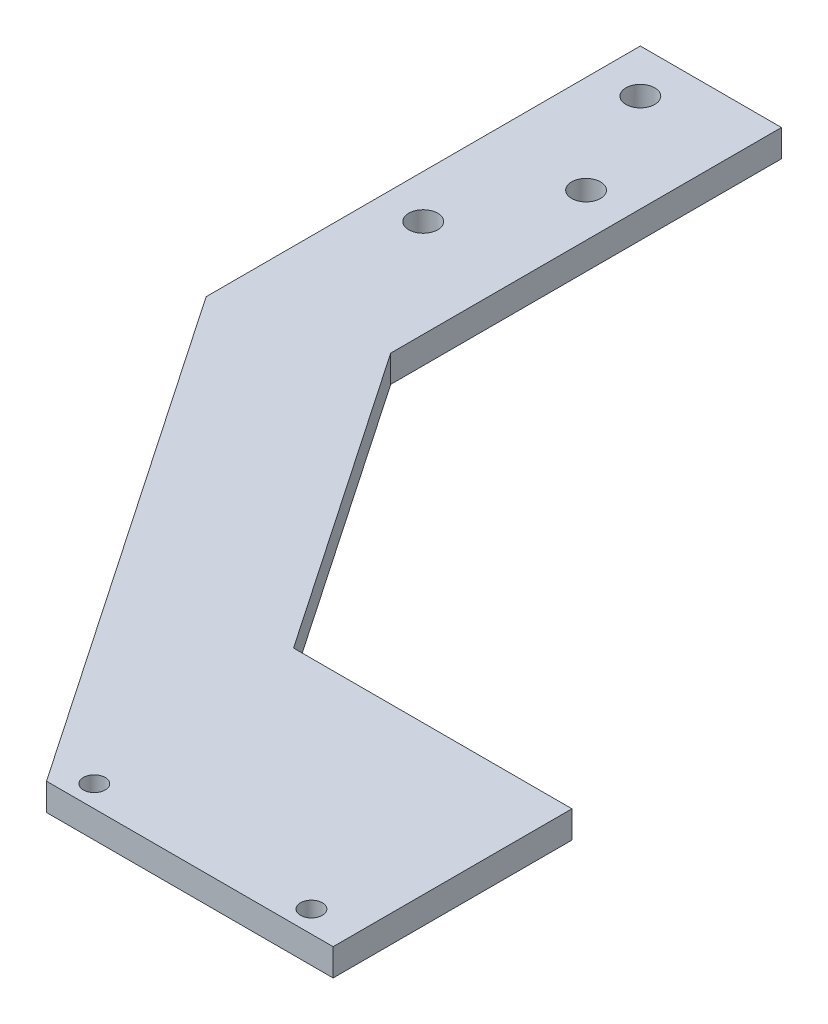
ISO-10303-21;
HEADER;
FILE_DESCRIPTION(('STEP AP214'),'2;1');
FILE_NAME('part.step','',(''),(''),'','','');
FILE_SCHEMA(('AUTOMOTIVE_DESIGN { 1 0 10303 214 1 1 1 1 }'));
ENDSEC;
DATA;
#1=APPLICATION_CONTEXT('core data for automotive mechanical design processes');
#2=APPLICATION_PROTOCOL_DEFINITION('international standard','automotive_design',2000,#1);
#3=PRODUCT_CONTEXT('',#1,'mechanical');
#4=PRODUCT('Part','Part','',(#3));
#5=PRODUCT_RELATED_PRODUCT_CATEGORY('part','',(#4));
#6=PRODUCT_DEFINITION_FORMATION('','',#4);
#7=PRODUCT_DEFINITION_CONTEXT('part definition',#1,'design');
#8=PRODUCT_DEFINITION('design','',#6,#7);
#9=PRODUCT_DEFINITION_SHAPE('','',#8);
#10=(LENGTH_UNIT() NAMED_UNIT(*) SI_UNIT(.MILLI.,.METRE.));
#11=(NAMED_UNIT(*) PLANE_ANGLE_UNIT() SI_UNIT($,.RADIAN.));
#12=(NAMED_UNIT(*) SI_UNIT($,.STERADIAN.) SOLID_ANGLE_UNIT());
#13=UNCERTAINTY_MEASURE_WITH_UNIT(LENGTH_MEASURE(1.E-05),#10,'distance_accuracy_value','');
#14=(GEOMETRIC_REPRESENTATION_CONTEXT(3) GLOBAL_UNCERTAINTY_ASSIGNED_CONTEXT((#13)) GLOBAL_UNIT_ASSIGNED_CONTEXT((#10,
#11,#12)) REPRESENTATION_CONTEXT('',''));
#15=CARTESIAN_POINT('',(0.,0.,0.));
#16=DIRECTION('',(0.,0.,1.));
#17=DIRECTION('',(1.,0.,0.));
#18=AXIS2_PLACEMENT_3D('',#15,#16,#17);
#19=CARTESIAN_POINT('',(0.,6.35,0.));
#20=DIRECTION('',(0.,-1.,0.));
#21=DIRECTION('',(0.,0.,-1.));
#22=AXIS2_PLACEMENT_3D('',#19,#20,#21);
#23=PLANE('',#22);
#24=CARTESIAN_POINT('',(85.598,6.35,213.36));
#25=DIRECTION('',(0.,1.,0.));
#26=DIRECTION('',(0.,0.,1.));
#27=AXIS2_PLACEMENT_3D('',#24,#25,#26);
#28=CIRCLE('',#27,2.55270000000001);
#29=CARTESIAN_POINT('',(85.598,6.35,215.9127));
#30=VERTEX_POINT('',#29);
#31=EDGE_CURVE('E191',#30,#30,#28,.T.);
#32=ORIENTED_EDGE('',*,*,#31,.F.);
#33=EDGE_LOOP('',(#32));
#34=FACE_BOUND('',#33,.T.);
#35=CARTESIAN_POINT('',(136.398,6.35,213.36));
#36=DIRECTION('',(0.,1.,0.));
#37=DIRECTION('',(0.,0.,1.));
#38=AXIS2_PLACEMENT_3D('',#35,#36,#37);
#39=CIRCLE('',#38,2.55269999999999);
#40=CARTESIAN_POINT('',(136.398,6.35,215.9127));
#41=VERTEX_POINT('',#40);
#42=EDGE_CURVE('E181',#41,#41,#39,.T.);
#43=ORIENTED_EDGE('',*,*,#42,.F.);
#44=EDGE_LOOP('',(#43));
#45=FACE_BOUND('',#44,.T.);
#46=CARTESIAN_POINT('',(10.16,6.35,10.16));
#47=DIRECTION('',(0.,1.,0.));
#48=DIRECTION('',(0.,0.,1.));
#49=AXIS2_PLACEMENT_3D('',#46,#47,#48);
#50=CIRCLE('',#49,3.3782);
#51=CARTESIAN_POINT('',(10.16,6.35,13.5382));
#52=VERTEX_POINT('',#51);
#53=EDGE_CURVE('E178',#52,#52,#50,.T.);
#54=ORIENTED_EDGE('',*,*,#53,.F.);
#55=EDGE_LOOP('',(#54));
#56=FACE_BOUND('',#55,.T.);
#57=CARTESIAN_POINT('',(10.16,6.35,60.96));
#58=DIRECTION('',(0.,1.,0.));
#59=DIRECTION('',(0.,0.,1.));
#60=AXIS2_PLACEMENT_3D('',#57,#58,#59);
#61=CIRCLE('',#60,3.3782);
#62=CARTESIAN_POINT('',(10.16,6.35,64.3382));
#63=VERTEX_POINT('',#62);
#64=EDGE_CURVE('E171',#63,#63,#61,.T.);
#65=ORIENTED_EDGE('',*,*,#64,.F.);
#66=EDGE_LOOP('',(#65));
#67=FACE_BOUND('',#66,.T.);
#68=DIRECTION('',(0.,0.,1.));
#69=VECTOR('',#68,1.);
#70=CARTESIAN_POINT('',(0.,6.35,101.6));
#71=LINE('',#70,#69);
#72=CARTESIAN_POINT('',(0.,6.35,0.));
#73=VERTEX_POINT('',#72);
#74=CARTESIAN_POINT('',(0.,6.35,101.6));
#75=VERTEX_POINT('',#74);
#76=EDGE_CURVE('E157',#73,#75,#71,.T.);
#77=ORIENTED_EDGE('',*,*,#76,.T.);
#78=DIRECTION('',(0.562555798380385,0.,0.826759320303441));
#79=VECTOR('',#78,1.);
#80=CARTESIAN_POINT('',(79.502,6.35,218.44));
#81=LINE('',#80,#79);
#82=CARTESIAN_POINT('',(79.502,6.35,218.44));
#83=VERTEX_POINT('',#82);
#84=EDGE_CURVE('E105',#75,#83,#81,.T.);
#85=ORIENTED_EDGE('',*,*,#84,.T.);
#86=DIRECTION('',(1.,0.,0.));
#87=VECTOR('',#86,1.);
#88=CARTESIAN_POINT('',(146.558,6.35,218.44));
#89=LINE('',#88,#87);
#90=CARTESIAN_POINT('',(146.558,6.35,218.44));
#91=VERTEX_POINT('',#90);
#92=EDGE_CURVE('E200',#83,#91,#89,.T.);
#93=ORIENTED_EDGE('',*,*,#92,.T.);
#94=DIRECTION('',(0.,0.,-1.));
#95=VECTOR('',#94,1.);
#96=CARTESIAN_POINT('',(146.558,6.35,162.56));
#97=LINE('',#96,#95);
#98=CARTESIAN_POINT('',(146.558,6.35,162.56));
#99=VERTEX_POINT('',#98);
#100=EDGE_CURVE('E202',#91,#99,#97,.T.);
#101=ORIENTED_EDGE('',*,*,#100,.T.);
#102=DIRECTION('',(-1.,0.,0.));
#103=VECTOR('',#102,1.);
#104=CARTESIAN_POINT('',(81.4183763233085,6.35,162.56));
#105=LINE('',#104,#103);
#106=CARTESIAN_POINT('',(81.4183763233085,6.35,162.56));
#107=VERTEX_POINT('',#106);
#108=EDGE_CURVE('E124',#99,#107,#105,.T.);
#109=ORIENTED_EDGE('',*,*,#108,.T.);
#110=DIRECTION('',(-0.562555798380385,0.,-0.826759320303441));
#111=VECTOR('',#110,1.);
#112=CARTESIAN_POINT('',(81.4183763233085,6.35,162.56));
#113=LINE('',#112,#111);
#114=CARTESIAN_POINT('',(33.02,6.35,91.43139581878));
#115=VERTEX_POINT('',#114);
#116=EDGE_CURVE('E118',#107,#115,#113,.T.);
#117=ORIENTED_EDGE('',*,*,#116,.T.);
#118=DIRECTION('',(0.,0.,-1.));
#119=VECTOR('',#118,1.);
#120=CARTESIAN_POINT('',(33.02,6.35,0.));
#121=LINE('',#120,#119);
#122=CARTESIAN_POINT('',(33.02,6.35,0.));
#123=VERTEX_POINT('',#122);
#124=EDGE_CURVE('E122',#115,#123,#121,.T.);
#125=ORIENTED_EDGE('',*,*,#124,.T.);
#126=DIRECTION('',(-1.,0.,0.));
#127=VECTOR('',#126,1.);
#128=CARTESIAN_POINT('',(0.,6.35,0.));
#129=LINE('',#128,#127);
#130=EDGE_CURVE('E62',#123,#73,#129,.T.);
#131=ORIENTED_EDGE('',*,*,#130,.T.);
#132=EDGE_LOOP('',(#77,#85,#93,#101,#109,#117,#125,#131));
#133=FACE_BOUND('',#132,.T.);
#134=CARTESIAN_POINT('',(22.86,6.35,35.56));
#135=DIRECTION('',(0.,1.,0.));
#136=DIRECTION('',(0.,0.,1.));
#137=AXIS2_PLACEMENT_3D('',#134,#135,#136);
#138=CIRCLE('',#137,3.3782);
#139=CARTESIAN_POINT('',(22.86,6.35,38.9382));
#140=VERTEX_POINT('',#139);
#141=EDGE_CURVE('E175',#140,#140,#138,.T.);
#142=ORIENTED_EDGE('',*,*,#141,.F.);
#143=EDGE_LOOP('',(#142));
#144=FACE_BOUND('',#143,.T.);
#145=ADVANCED_FACE('F43',(#34,#45,#56,#67,#133,#144),#23,.F.);
#146=CARTESIAN_POINT('',(0.,6.35,101.6));
#147=DIRECTION('',(1.,0.,0.));
#148=DIRECTION('',(0.,0.,-1.));
#149=AXIS2_PLACEMENT_3D('',#146,#147,#148);
#150=PLANE('',#149);
#151=DIRECTION('',(0.,0.,1.));
#152=VECTOR('',#151,1.);
#153=CARTESIAN_POINT('',(0.,0.,101.6));
#154=LINE('',#153,#152);
#155=CARTESIAN_POINT('',(0.,0.,0.));
#156=VERTEX_POINT('',#155);
#157=CARTESIAN_POINT('',(0.,0.,101.6));
#158=VERTEX_POINT('',#157);
#159=EDGE_CURVE('E142',#156,#158,#154,.T.);
#160=ORIENTED_EDGE('',*,*,#159,.T.);
#161=DIRECTION('',(0.,-1.,0.));
#162=VECTOR('',#161,1.);
#163=CARTESIAN_POINT('',(0.,6.35,101.6));
#164=LINE('',#163,#162);
#165=EDGE_CURVE('E11',#75,#158,#164,.T.);
#166=ORIENTED_EDGE('',*,*,#165,.F.);
#167=ORIENTED_EDGE('',*,*,#76,.F.);
#168=DIRECTION('',(0.,-1.,0.));
#169=VECTOR('',#168,1.);
#170=CARTESIAN_POINT('',(0.,6.35,0.));
#171=LINE('',#170,#169);
#172=EDGE_CURVE('E138',#73,#156,#171,.T.);
#173=ORIENTED_EDGE('',*,*,#172,.T.);
#174=EDGE_LOOP('',(#160,#166,#167,#173));
#175=FACE_BOUND('',#174,.T.);
#176=ADVANCED_FACE('F45',(#175),#150,.F.);
#177=CARTESIAN_POINT('',(79.502,6.35,218.44));
#178=DIRECTION('',(0.826759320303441,0.,-0.562555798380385));
#179=DIRECTION('',(-0.562555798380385,0.,-0.826759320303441));
#180=AXIS2_PLACEMENT_3D('',#177,#178,#179);
#181=PLANE('',#180);
#182=DIRECTION('',(0.562555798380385,0.,0.826759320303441));
#183=VECTOR('',#182,1.);
#184=CARTESIAN_POINT('',(79.502,0.,218.44));
#185=LINE('',#184,#183);
#186=CARTESIAN_POINT('',(79.502,0.,218.44));
#187=VERTEX_POINT('',#186);
#188=EDGE_CURVE('E145',#158,#187,#185,.T.);
#189=ORIENTED_EDGE('',*,*,#188,.T.);
#190=DIRECTION('',(0.,-1.,0.));
#191=VECTOR('',#190,1.);
#192=CARTESIAN_POINT('',(79.502,6.35,218.44));
#193=LINE('',#192,#191);
#194=EDGE_CURVE('E53',#83,#187,#193,.T.);
#195=ORIENTED_EDGE('',*,*,#194,.F.);
#196=ORIENTED_EDGE('',*,*,#84,.F.);
#197=ORIENTED_EDGE('',*,*,#165,.T.);
#198=EDGE_LOOP('',(#189,#195,#196,#197));
#199=FACE_BOUND('',#198,.T.);
#200=ADVANCED_FACE('F239',(#199),#181,.F.);
#201=CARTESIAN_POINT('',(146.558,6.35,218.44));
#202=DIRECTION('',(0.,0.,-1.));
#203=DIRECTION('',(-1.,0.,0.));
#204=AXIS2_PLACEMENT_3D('',#201,#202,#203);
#205=PLANE('',#204);
#206=DIRECTION('',(1.,0.,0.));
#207=VECTOR('',#206,1.);
#208=CARTESIAN_POINT('',(146.558,0.,218.44));
#209=LINE('',#208,#207);
#210=CARTESIAN_POINT('',(146.558,0.,218.44));
#211=VERTEX_POINT('',#210);
#212=EDGE_CURVE('E148',#187,#211,#209,.T.);
#213=ORIENTED_EDGE('',*,*,#212,.T.);
#214=DIRECTION('',(0.,-1.,0.));
#215=VECTOR('',#214,1.);
#216=CARTESIAN_POINT('',(146.558,6.35,218.44));
#217=LINE('',#216,#215);
#218=EDGE_CURVE('E164',#91,#211,#217,.T.);
#219=ORIENTED_EDGE('',*,*,#218,.F.);
#220=ORIENTED_EDGE('',*,*,#92,.F.);
#221=ORIENTED_EDGE('',*,*,#194,.T.);
#222=EDGE_LOOP('',(#213,#219,#220,#221));
#223=FACE_BOUND('',#222,.T.);
#224=ADVANCED_FACE('F348',(#223),#205,.F.);
#225=CARTESIAN_POINT('',(146.558,6.35,162.56));
#226=DIRECTION('',(-1.,0.,0.));
#227=DIRECTION('',(0.,0.,1.));
#228=AXIS2_PLACEMENT_3D('',#225,#226,#227);
#229=PLANE('',#228);
#230=DIRECTION('',(0.,0.,-1.));
#231=VECTOR('',#230,1.);
#232=CARTESIAN_POINT('',(146.558,0.,162.56));
#233=LINE('',#232,#231);
#234=CARTESIAN_POINT('',(146.558,0.,162.56));
#235=VERTEX_POINT('',#234);
#236=EDGE_CURVE('E150',#211,#235,#233,.T.);
#237=ORIENTED_EDGE('',*,*,#236,.T.);
#238=DIRECTION('',(0.,-1.,0.));
#239=VECTOR('',#238,1.);
#240=CARTESIAN_POINT('',(146.558,6.35,162.56));
#241=LINE('',#240,#239);
#242=EDGE_CURVE('E161',#99,#235,#241,.T.);
#243=ORIENTED_EDGE('',*,*,#242,.F.);
#244=ORIENTED_EDGE('',*,*,#100,.F.);
#245=ORIENTED_EDGE('',*,*,#218,.T.);
#246=EDGE_LOOP('',(#237,#243,#244,#245));
#247=FACE_BOUND('',#246,.T.);
#248=ADVANCED_FACE('F208',(#247),#229,.F.);
#249=CARTESIAN_POINT('',(81.4183763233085,6.35,162.56));
#250=DIRECTION('',(0.,0.,1.));
#251=DIRECTION('',(1.,0.,0.));
#252=AXIS2_PLACEMENT_3D('',#249,#250,#251);
#253=PLANE('',#252);
#254=DIRECTION('',(-1.,0.,0.));
#255=VECTOR('',#254,1.);
#256=CARTESIAN_POINT('',(81.4183763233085,0.,162.56));
#257=LINE('',#256,#255);
#258=CARTESIAN_POINT('',(81.4183763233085,0.,162.56));
#259=VERTEX_POINT('',#258);
#260=EDGE_CURVE('E152',#235,#259,#257,.T.);
#261=ORIENTED_EDGE('',*,*,#260,.T.);
#262=DIRECTION('',(0.,-1.,0.));
#263=VECTOR('',#262,1.);
#264=CARTESIAN_POINT('',(81.4183763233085,6.35,162.56));
#265=LINE('',#264,#263);
#266=EDGE_CURVE('E133',#107,#259,#265,.T.);
#267=ORIENTED_EDGE('',*,*,#266,.F.);
#268=ORIENTED_EDGE('',*,*,#108,.F.);
#269=ORIENTED_EDGE('',*,*,#242,.T.);
#270=EDGE_LOOP('',(#261,#267,#268,#269));
#271=FACE_BOUND('',#270,.T.);
#272=ADVANCED_FACE('F212',(#271),#253,.F.);
#273=CARTESIAN_POINT('',(81.4183763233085,6.35,162.56));
#274=DIRECTION('',(-0.826759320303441,0.,0.562555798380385));
#275=DIRECTION('',(0.562555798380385,0.,0.826759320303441));
#276=AXIS2_PLACEMENT_3D('',#273,#274,#275);
#277=PLANE('',#276);
#278=DIRECTION('',(-0.562555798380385,0.,-0.826759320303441));
#279=VECTOR('',#278,1.);
#280=CARTESIAN_POINT('',(81.4183763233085,0.,162.56));
#281=LINE('',#280,#279);
#282=CARTESIAN_POINT('',(33.02,0.,91.43139581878));
#283=VERTEX_POINT('',#282);
#284=EDGE_CURVE('E132',#259,#283,#281,.T.);
#285=ORIENTED_EDGE('',*,*,#284,.T.);
#286=DIRECTION('',(0.,-1.,0.));
#287=VECTOR('',#286,1.);
#288=CARTESIAN_POINT('',(33.02,6.35,91.43139581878));
#289=LINE('',#288,#287);
#290=EDGE_CURVE('E129',#115,#283,#289,.T.);
#291=ORIENTED_EDGE('',*,*,#290,.F.);
#292=ORIENTED_EDGE('',*,*,#116,.F.);
#293=ORIENTED_EDGE('',*,*,#266,.T.);
#294=EDGE_LOOP('',(#285,#291,#292,#293));
#295=FACE_BOUND('',#294,.T.);
#296=ADVANCED_FACE('F130',(#295),#277,.F.);
#297=CARTESIAN_POINT('',(33.02,6.35,0.));
#298=DIRECTION('',(-1.,0.,0.));
#299=DIRECTION('',(0.,0.,1.));
#300=AXIS2_PLACEMENT_3D('',#297,#298,#299);
#301=PLANE('',#300);
#302=DIRECTION('',(0.,0.,-1.));
#303=VECTOR('',#302,1.);
#304=CARTESIAN_POINT('',(33.02,0.,0.));
#305=LINE('',#304,#303);
#306=CARTESIAN_POINT('',(33.02,0.,0.));
#307=VERTEX_POINT('',#306);
#308=EDGE_CURVE('E91',#283,#307,#305,.T.);
#309=ORIENTED_EDGE('',*,*,#308,.T.);
#310=DIRECTION('',(0.,-1.,0.));
#311=VECTOR('',#310,1.);
#312=CARTESIAN_POINT('',(33.02,6.35,0.));
#313=LINE('',#312,#311);
#314=EDGE_CURVE('E134',#123,#307,#313,.T.);
#315=ORIENTED_EDGE('',*,*,#314,.F.);
#316=ORIENTED_EDGE('',*,*,#124,.F.);
#317=ORIENTED_EDGE('',*,*,#290,.T.);
#318=EDGE_LOOP('',(#309,#315,#316,#317));
#319=FACE_BOUND('',#318,.T.);
#320=ADVANCED_FACE('F136',(#319),#301,.F.);
#321=CARTESIAN_POINT('',(0.,6.35,0.));
#322=DIRECTION('',(0.,0.,1.));
#323=DIRECTION('',(1.,0.,0.));
#324=AXIS2_PLACEMENT_3D('',#321,#322,#323);
#325=PLANE('',#324);
#326=DIRECTION('',(-1.,0.,0.));
#327=VECTOR('',#326,1.);
#328=CARTESIAN_POINT('',(0.,0.,0.));
#329=LINE('',#328,#327);
#330=EDGE_CURVE('E97',#307,#156,#329,.T.);
#331=ORIENTED_EDGE('',*,*,#330,.T.);
#332=ORIENTED_EDGE('',*,*,#172,.F.);
#333=ORIENTED_EDGE('',*,*,#130,.F.);
#334=ORIENTED_EDGE('',*,*,#314,.T.);
#335=EDGE_LOOP('',(#331,#332,#333,#334));
#336=FACE_BOUND('',#335,.T.);
#337=ADVANCED_FACE('F220',(#336),#325,.F.);
#338=CARTESIAN_POINT('',(0.,0.,0.));
#339=DIRECTION('',(0.,-1.,0.));
#340=DIRECTION('',(0.,0.,-1.));
#341=AXIS2_PLACEMENT_3D('',#338,#339,#340);
#342=PLANE('',#341);
#343=CARTESIAN_POINT('',(85.598,0.,213.36));
#344=DIRECTION('',(0.,-1.,0.));
#345=DIRECTION('',(0.,0.,-1.));
#346=AXIS2_PLACEMENT_3D('',#343,#344,#345);
#347=CIRCLE('',#346,2.5527);
#348=CARTESIAN_POINT('',(85.598,0.,210.8073));
#349=VERTEX_POINT('',#348);
#350=EDGE_CURVE('E47',#349,#349,#347,.T.);
#351=ORIENTED_EDGE('',*,*,#350,.F.);
#352=EDGE_LOOP('',(#351));
#353=FACE_BOUND('',#352,.T.);
#354=CARTESIAN_POINT('',(136.398,0.,213.36));
#355=DIRECTION('',(0.,-1.,0.));
#356=DIRECTION('',(0.,0.,-1.));
#357=AXIS2_PLACEMENT_3D('',#354,#355,#356);
#358=CIRCLE('',#357,2.55269999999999);
#359=CARTESIAN_POINT('',(136.398,0.,210.8073));
#360=VERTEX_POINT('',#359);
#361=EDGE_CURVE('E179',#360,#360,#358,.T.);
#362=ORIENTED_EDGE('',*,*,#361,.F.);
#363=EDGE_LOOP('',(#362));
#364=FACE_BOUND('',#363,.T.);
#365=CARTESIAN_POINT('',(10.16,0.,10.16));
#366=DIRECTION('',(0.,-1.,0.));
#367=DIRECTION('',(0.,0.,-1.));
#368=AXIS2_PLACEMENT_3D('',#365,#366,#367);
#369=CIRCLE('',#368,3.3782);
#370=CARTESIAN_POINT('',(10.16,0.,6.7818));
#371=VERTEX_POINT('',#370);
#372=EDGE_CURVE('E176',#371,#371,#369,.T.);
#373=ORIENTED_EDGE('',*,*,#372,.F.);
#374=EDGE_LOOP('',(#373));
#375=FACE_BOUND('',#374,.T.);
#376=CARTESIAN_POINT('',(22.86,0.,35.56));
#377=DIRECTION('',(0.,-1.,0.));
#378=DIRECTION('',(0.,0.,-1.));
#379=AXIS2_PLACEMENT_3D('',#376,#377,#378);
#380=CIRCLE('',#379,3.3782);
#381=CARTESIAN_POINT('',(22.86,0.,32.1818));
#382=VERTEX_POINT('',#381);
#383=EDGE_CURVE('E172',#382,#382,#380,.T.);
#384=ORIENTED_EDGE('',*,*,#383,.F.);
#385=EDGE_LOOP('',(#384));
#386=FACE_BOUND('',#385,.T.);
#387=CARTESIAN_POINT('',(10.16,0.,60.96));
#388=DIRECTION('',(0.,-1.,0.));
#389=DIRECTION('',(0.,0.,-1.));
#390=AXIS2_PLACEMENT_3D('',#387,#388,#389);
#391=CIRCLE('',#390,3.3782);
#392=CARTESIAN_POINT('',(10.16,0.,57.5818));
#393=VERTEX_POINT('',#392);
#394=EDGE_CURVE('E146',#393,#393,#391,.T.);
#395=ORIENTED_EDGE('',*,*,#394,.F.);
#396=EDGE_LOOP('',(#395));
#397=FACE_BOUND('',#396,.T.);
#398=ORIENTED_EDGE('',*,*,#159,.F.);
#399=ORIENTED_EDGE('',*,*,#330,.F.);
#400=ORIENTED_EDGE('',*,*,#308,.F.);
#401=ORIENTED_EDGE('',*,*,#284,.F.);
#402=ORIENTED_EDGE('',*,*,#260,.F.);
#403=ORIENTED_EDGE('',*,*,#236,.F.);
#404=ORIENTED_EDGE('',*,*,#212,.F.);
#405=ORIENTED_EDGE('',*,*,#188,.F.);
#406=EDGE_LOOP('',(#398,#399,#400,#401,#402,#403,#404,#405));
#407=FACE_BOUND('',#406,.T.);
#408=ADVANCED_FACE('F215',(#353,#364,#375,#386,#397,#407),#342,.T.);
#409=CARTESIAN_POINT('',(10.16,6.35,60.96));
#410=DIRECTION('',(0.,1.,0.));
#411=DIRECTION('',(0.,0.,1.));
#412=AXIS2_PLACEMENT_3D('',#409,#410,#411);
#413=CYLINDRICAL_SURFACE('',#412,3.3782);
#414=ORIENTED_EDGE('',*,*,#394,.T.);
#415=EDGE_LOOP('',(#414));
#416=FACE_BOUND('',#415,.T.);
#417=ORIENTED_EDGE('',*,*,#64,.T.);
#418=EDGE_LOOP('',(#417));
#419=FACE_BOUND('',#418,.T.);
#420=ADVANCED_FACE('F228',(#416,#419),#413,.F.);
#421=CARTESIAN_POINT('',(22.86,6.35,35.56));
#422=DIRECTION('',(0.,1.,0.));
#423=DIRECTION('',(0.,0.,1.));
#424=AXIS2_PLACEMENT_3D('',#421,#422,#423);
#425=CYLINDRICAL_SURFACE('',#424,3.3782);
#426=ORIENTED_EDGE('',*,*,#383,.T.);
#427=EDGE_LOOP('',(#426));
#428=FACE_BOUND('',#427,.T.);
#429=ORIENTED_EDGE('',*,*,#141,.T.);
#430=EDGE_LOOP('',(#429));
#431=FACE_BOUND('',#430,.T.);
#432=ADVANCED_FACE('F244',(#428,#431),#425,.F.);
#433=CARTESIAN_POINT('',(10.16,6.35,10.16));
#434=DIRECTION('',(0.,1.,0.));
#435=DIRECTION('',(0.,0.,1.));
#436=AXIS2_PLACEMENT_3D('',#433,#434,#435);
#437=CYLINDRICAL_SURFACE('',#436,3.3782);
#438=ORIENTED_EDGE('',*,*,#372,.T.);
#439=EDGE_LOOP('',(#438));
#440=FACE_BOUND('',#439,.T.);
#441=ORIENTED_EDGE('',*,*,#53,.T.);
#442=EDGE_LOOP('',(#441));
#443=FACE_BOUND('',#442,.T.);
#444=ADVANCED_FACE('F248',(#440,#443),#437,.F.);
#445=CARTESIAN_POINT('',(136.398,6.35,213.36));
#446=DIRECTION('',(0.,1.,0.));
#447=DIRECTION('',(0.,0.,1.));
#448=AXIS2_PLACEMENT_3D('',#445,#446,#447);
#449=CYLINDRICAL_SURFACE('',#448,2.55269999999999);
#450=ORIENTED_EDGE('',*,*,#361,.T.);
#451=EDGE_LOOP('',(#450));
#452=FACE_BOUND('',#451,.T.);
#453=ORIENTED_EDGE('',*,*,#42,.T.);
#454=EDGE_LOOP('',(#453));
#455=FACE_BOUND('',#454,.T.);
#456=ADVANCED_FACE('F251',(#452,#455),#449,.F.);
#457=CARTESIAN_POINT('',(85.598,6.35,213.36));
#458=DIRECTION('',(0.,1.,0.));
#459=DIRECTION('',(0.,0.,1.));
#460=AXIS2_PLACEMENT_3D('',#457,#458,#459);
#461=CYLINDRICAL_SURFACE('',#460,2.5527);
#462=ORIENTED_EDGE('',*,*,#350,.T.);
#463=EDGE_LOOP('',(#462));
#464=FACE_BOUND('',#463,.T.);
#465=ORIENTED_EDGE('',*,*,#31,.T.);
#466=EDGE_LOOP('',(#465));
#467=FACE_BOUND('',#466,.T.);
#468=ADVANCED_FACE('F255',(#464,#467),#461,.F.);
#469=CLOSED_SHELL('',(#145,#176,#200,#224,#248,#272,#296,#320,#337,#408,#420,#432,#444,#456,#468));
#470=MANIFOLD_SOLID_BREP('B2',#469);
#471=ADVANCED_BREP_SHAPE_REPRESENTATION('',(#18,#470),#14);
#472=SHAPE_DEFINITION_REPRESENTATION(#9,#471);
ENDSEC;
END-ISO-10303-21;
